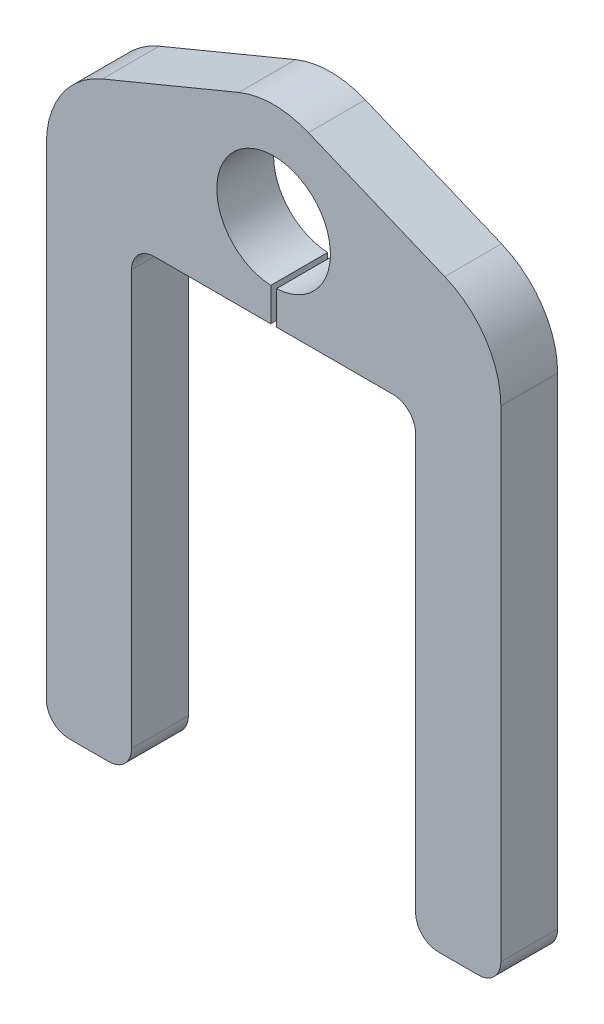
ISO-10303-21;
HEADER;
FILE_DESCRIPTION(('STEP AP214'),'2;1');
FILE_NAME('part.step','',(''),(''),'','','');
FILE_SCHEMA(('AUTOMOTIVE_DESIGN { 1 0 10303 214 1 1 1 1 }'));
ENDSEC;
DATA;
#1=APPLICATION_CONTEXT('core data for automotive mechanical design processes');
#2=APPLICATION_PROTOCOL_DEFINITION('international standard','automotive_design',2000,#1);
#3=PRODUCT_CONTEXT('',#1,'mechanical');
#4=PRODUCT('Part','Part','',(#3));
#5=PRODUCT_RELATED_PRODUCT_CATEGORY('part','',(#4));
#6=PRODUCT_DEFINITION_FORMATION('','',#4);
#7=PRODUCT_DEFINITION_CONTEXT('part definition',#1,'design');
#8=PRODUCT_DEFINITION('design','',#6,#7);
#9=PRODUCT_DEFINITION_SHAPE('','',#8);
#10=(LENGTH_UNIT() NAMED_UNIT(*) SI_UNIT(.MILLI.,.METRE.));
#11=(NAMED_UNIT(*) PLANE_ANGLE_UNIT() SI_UNIT($,.RADIAN.));
#12=(NAMED_UNIT(*) SI_UNIT($,.STERADIAN.) SOLID_ANGLE_UNIT());
#13=UNCERTAINTY_MEASURE_WITH_UNIT(LENGTH_MEASURE(1.E-05),#10,'distance_accuracy_value','');
#14=(GEOMETRIC_REPRESENTATION_CONTEXT(3) GLOBAL_UNCERTAINTY_ASSIGNED_CONTEXT((#13)) GLOBAL_UNIT_ASSIGNED_CONTEXT((#10,
#11,#12)) REPRESENTATION_CONTEXT('',''));
#15=CARTESIAN_POINT('',(0.,0.,0.));
#16=DIRECTION('',(0.,0.,1.));
#17=DIRECTION('',(1.,0.,0.));
#18=AXIS2_PLACEMENT_3D('',#15,#16,#17);
#19=CARTESIAN_POINT('',(376.037881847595,299.851744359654,31.75));
#20=DIRECTION('',(0.,1.,0.));
#21=DIRECTION('',(0.,0.,1.));
#22=AXIS2_PLACEMENT_3D('',#19,#20,#21);
#23=PLANE('',#22);
#24=DIRECTION('',(1.,0.,0.));
#25=VECTOR('',#24,1.);
#26=CARTESIAN_POINT('',(376.037881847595,299.851744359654,0.));
#27=LINE('',#26,#25);
#28=CARTESIAN_POINT('',(310.950381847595,299.851744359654,0.));
#29=VERTEX_POINT('',#28);
#30=CARTESIAN_POINT('',(376.037881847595,299.851744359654,0.));
#31=VERTEX_POINT('',#30);
#32=EDGE_CURVE('E215',#29,#31,#27,.T.);
#33=ORIENTED_EDGE('',*,*,#32,.T.);
#34=DIRECTION('',(0.,0.,-1.));
#35=VECTOR('',#34,1.);
#36=CARTESIAN_POINT('',(376.037881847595,299.851744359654,31.75));
#37=LINE('',#36,#35);
#38=CARTESIAN_POINT('',(376.037881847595,299.851744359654,31.75));
#39=VERTEX_POINT('',#38);
#40=EDGE_CURVE('E11',#39,#31,#37,.T.);
#41=ORIENTED_EDGE('',*,*,#40,.F.);
#42=DIRECTION('',(1.,0.,0.));
#43=VECTOR('',#42,1.);
#44=CARTESIAN_POINT('',(376.037881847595,299.851744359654,31.75));
#45=LINE('',#44,#43);
#46=CARTESIAN_POINT('',(310.950381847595,299.851744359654,31.75));
#47=VERTEX_POINT('',#46);
#48=EDGE_CURVE('E257',#47,#39,#45,.T.);
#49=ORIENTED_EDGE('',*,*,#48,.F.);
#50=DIRECTION('',(0.,0.,-1.));
#51=VECTOR('',#50,1.);
#52=CARTESIAN_POINT('',(310.950381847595,299.851744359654,31.75));
#53=LINE('',#52,#51);
#54=EDGE_CURVE('E211',#47,#29,#53,.T.);
#55=ORIENTED_EDGE('',*,*,#54,.T.);
#56=EDGE_LOOP('',(#33,#41,#49,#55));
#57=FACE_BOUND('',#56,.T.);
#58=ADVANCED_FACE('F35',(#57),#23,.F.);
#59=CARTESIAN_POINT('',(376.037881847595,287.151744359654,31.75));
#60=DIRECTION('',(0.,0.,-1.));
#61=DIRECTION('',(-1.,0.,0.));
#62=AXIS2_PLACEMENT_3D('',#59,#60,#61);
#63=CYLINDRICAL_SURFACE('',#62,12.7);
#64=CARTESIAN_POINT('',(376.037881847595,287.151744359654,0.));
#65=DIRECTION('',(0.,0.,-1.));
#66=DIRECTION('',(1.,0.,0.));
#67=AXIS2_PLACEMENT_3D('',#64,#65,#66);
#68=CIRCLE('',#67,12.7);
#69=CARTESIAN_POINT('',(388.737881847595,287.151744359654,0.));
#70=VERTEX_POINT('',#69);
#71=EDGE_CURVE('E218',#31,#70,#68,.T.);
#72=ORIENTED_EDGE('',*,*,#71,.T.);
#73=DIRECTION('',(0.,0.,-1.));
#74=VECTOR('',#73,1.);
#75=CARTESIAN_POINT('',(388.737881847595,287.151744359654,31.75));
#76=LINE('',#75,#74);
#77=CARTESIAN_POINT('',(388.737881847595,287.151744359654,31.75));
#78=VERTEX_POINT('',#77);
#79=EDGE_CURVE('E43',#78,#70,#76,.T.);
#80=ORIENTED_EDGE('',*,*,#79,.F.);
#81=CARTESIAN_POINT('',(376.037881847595,287.151744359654,31.75));
#82=DIRECTION('',(0.,0.,-1.));
#83=DIRECTION('',(1.,0.,0.));
#84=AXIS2_PLACEMENT_3D('',#81,#82,#83);
#85=CIRCLE('',#84,12.7);
#86=EDGE_CURVE('E136',#39,#78,#85,.T.);
#87=ORIENTED_EDGE('',*,*,#86,.F.);
#88=ORIENTED_EDGE('',*,*,#40,.T.);
#89=EDGE_LOOP('',(#72,#80,#87,#88));
#90=FACE_BOUND('',#89,.T.);
#91=ADVANCED_FACE('F385',(#90),#63,.F.);
#92=CARTESIAN_POINT('',(388.737881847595,287.151744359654,31.75));
#93=DIRECTION('',(1.,0.,0.));
#94=DIRECTION('',(0.,1.,0.));
#95=AXIS2_PLACEMENT_3D('',#92,#93,#94);
#96=PLANE('',#95);
#97=DIRECTION('',(0.,-1.,0.));
#98=VECTOR('',#97,1.);
#99=CARTESIAN_POINT('',(388.737881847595,287.151744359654,0.));
#100=LINE('',#99,#98);
#101=CARTESIAN_POINT('',(388.737881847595,55.3767443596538,0.));
#102=VERTEX_POINT('',#101);
#103=EDGE_CURVE('E220',#70,#102,#100,.T.);
#104=ORIENTED_EDGE('',*,*,#103,.T.);
#105=DIRECTION('',(0.,0.,-1.));
#106=VECTOR('',#105,1.);
#107=CARTESIAN_POINT('',(388.737881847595,55.3767443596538,31.75));
#108=LINE('',#107,#106);
#109=CARTESIAN_POINT('',(388.737881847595,55.3767443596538,31.75));
#110=VERTEX_POINT('',#109);
#111=EDGE_CURVE('E306',#110,#102,#108,.T.);
#112=ORIENTED_EDGE('',*,*,#111,.F.);
#113=DIRECTION('',(0.,-1.,0.));
#114=VECTOR('',#113,1.);
#115=CARTESIAN_POINT('',(388.737881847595,287.151744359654,31.75));
#116=LINE('',#115,#114);
#117=EDGE_CURVE('E314',#78,#110,#116,.T.);
#118=ORIENTED_EDGE('',*,*,#117,.F.);
#119=ORIENTED_EDGE('',*,*,#79,.T.);
#120=EDGE_LOOP('',(#104,#112,#118,#119));
#121=FACE_BOUND('',#120,.T.);
#122=ADVANCED_FACE('F312',(#121),#96,.F.);
#123=CARTESIAN_POINT('',(401.437881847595,55.3767443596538,31.75));
#124=DIRECTION('',(0.,0.,-1.));
#125=DIRECTION('',(-1.,0.,0.));
#126=AXIS2_PLACEMENT_3D('',#123,#124,#125);
#127=CYLINDRICAL_SURFACE('',#126,12.7);
#128=CARTESIAN_POINT('',(401.437881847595,55.3767443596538,0.));
#129=DIRECTION('',(0.,0.,1.));
#130=DIRECTION('',(1.,0.,0.));
#131=AXIS2_PLACEMENT_3D('',#128,#129,#130);
#132=CIRCLE('',#131,12.7);
#133=CARTESIAN_POINT('',(401.437881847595,42.6767443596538,0.));
#134=VERTEX_POINT('',#133);
#135=EDGE_CURVE('E222',#102,#134,#132,.T.);
#136=ORIENTED_EDGE('',*,*,#135,.T.);
#137=DIRECTION('',(0.,0.,-1.));
#138=VECTOR('',#137,1.);
#139=CARTESIAN_POINT('',(401.437881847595,42.6767443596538,31.75));
#140=LINE('',#139,#138);
#141=CARTESIAN_POINT('',(401.437881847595,42.6767443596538,31.75));
#142=VERTEX_POINT('',#141);
#143=EDGE_CURVE('E303',#142,#134,#140,.T.);
#144=ORIENTED_EDGE('',*,*,#143,.F.);
#145=CARTESIAN_POINT('',(401.437881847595,55.3767443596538,31.75));
#146=DIRECTION('',(0.,0.,1.));
#147=DIRECTION('',(1.,0.,0.));
#148=AXIS2_PLACEMENT_3D('',#145,#146,#147);
#149=CIRCLE('',#148,12.7);
#150=EDGE_CURVE('E332',#110,#142,#149,.T.);
#151=ORIENTED_EDGE('',*,*,#150,.F.);
#152=ORIENTED_EDGE('',*,*,#111,.T.);
#153=EDGE_LOOP('',(#136,#144,#151,#152));
#154=FACE_BOUND('',#153,.T.);
#155=ADVANCED_FACE('F323',(#154),#127,.T.);
#156=CARTESIAN_POINT('',(401.437881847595,42.6767443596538,31.75));
#157=DIRECTION('',(0.,1.,0.));
#158=DIRECTION('',(0.,0.,1.));
#159=AXIS2_PLACEMENT_3D('',#156,#157,#158);
#160=PLANE('',#159);
#161=DIRECTION('',(1.,0.,0.));
#162=VECTOR('',#161,1.);
#163=CARTESIAN_POINT('',(401.437881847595,42.6767443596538,0.));
#164=LINE('',#163,#162);
#165=CARTESIAN_POINT('',(423.662881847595,42.6767443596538,0.));
#166=VERTEX_POINT('',#165);
#167=EDGE_CURVE('E224',#134,#166,#164,.T.);
#168=ORIENTED_EDGE('',*,*,#167,.T.);
#169=DIRECTION('',(0.,0.,-1.));
#170=VECTOR('',#169,1.);
#171=CARTESIAN_POINT('',(423.662881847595,42.6767443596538,31.75));
#172=LINE('',#171,#170);
#173=CARTESIAN_POINT('',(423.662881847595,42.6767443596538,31.75));
#174=VERTEX_POINT('',#173);
#175=EDGE_CURVE('E300',#174,#166,#172,.T.);
#176=ORIENTED_EDGE('',*,*,#175,.F.);
#177=DIRECTION('',(1.,0.,0.));
#178=VECTOR('',#177,1.);
#179=CARTESIAN_POINT('',(401.437881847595,42.6767443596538,31.75));
#180=LINE('',#179,#178);
#181=EDGE_CURVE('E329',#142,#174,#180,.T.);
#182=ORIENTED_EDGE('',*,*,#181,.F.);
#183=ORIENTED_EDGE('',*,*,#143,.T.);
#184=EDGE_LOOP('',(#168,#176,#182,#183));
#185=FACE_BOUND('',#184,.T.);
#186=ADVANCED_FACE('F327',(#185),#160,.F.);
#187=CARTESIAN_POINT('',(423.662881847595,55.3767443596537,31.75));
#188=DIRECTION('',(0.,0.,-1.));
#189=DIRECTION('',(-1.,0.,0.));
#190=AXIS2_PLACEMENT_3D('',#187,#188,#189);
#191=CYLINDRICAL_SURFACE('',#190,12.7);
#192=CARTESIAN_POINT('',(423.662881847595,55.3767443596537,0.));
#193=DIRECTION('',(0.,0.,1.));
#194=DIRECTION('',(1.,0.,0.));
#195=AXIS2_PLACEMENT_3D('',#192,#193,#194);
#196=CIRCLE('',#195,12.7);
#197=CARTESIAN_POINT('',(436.362881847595,55.3767443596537,0.));
#198=VERTEX_POINT('',#197);
#199=EDGE_CURVE('E226',#166,#198,#196,.T.);
#200=ORIENTED_EDGE('',*,*,#199,.T.);
#201=DIRECTION('',(0.,0.,-1.));
#202=VECTOR('',#201,1.);
#203=CARTESIAN_POINT('',(436.362881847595,55.3767443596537,31.75));
#204=LINE('',#203,#202);
#205=CARTESIAN_POINT('',(436.362881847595,55.3767443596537,31.75));
#206=VERTEX_POINT('',#205);
#207=EDGE_CURVE('E297',#206,#198,#204,.T.);
#208=ORIENTED_EDGE('',*,*,#207,.F.);
#209=CARTESIAN_POINT('',(423.662881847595,55.3767443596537,31.75));
#210=DIRECTION('',(0.,0.,1.));
#211=DIRECTION('',(1.,0.,0.));
#212=AXIS2_PLACEMENT_3D('',#209,#210,#211);
#213=CIRCLE('',#212,12.7);
#214=EDGE_CURVE('E331',#174,#206,#213,.T.);
#215=ORIENTED_EDGE('',*,*,#214,.F.);
#216=ORIENTED_EDGE('',*,*,#175,.T.);
#217=EDGE_LOOP('',(#200,#208,#215,#216));
#218=FACE_BOUND('',#217,.T.);
#219=ADVANCED_FACE('F398',(#218),#191,.T.);
#220=CARTESIAN_POINT('',(436.362881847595,324.39371610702,31.75));
#221=DIRECTION('',(-1.,0.,0.));
#222=DIRECTION('',(0.,-1.,0.));
#223=AXIS2_PLACEMENT_3D('',#220,#221,#222);
#224=PLANE('',#223);
#225=DIRECTION('',(0.,1.,0.));
#226=VECTOR('',#225,1.);
#227=CARTESIAN_POINT('',(436.362881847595,324.39371610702,0.));
#228=LINE('',#227,#226);
#229=CARTESIAN_POINT('',(436.362881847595,324.39371610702,0.));
#230=VERTEX_POINT('',#229);
#231=EDGE_CURVE('E228',#198,#230,#228,.T.);
#232=ORIENTED_EDGE('',*,*,#231,.T.);
#233=DIRECTION('',(0.,0.,-1.));
#234=VECTOR('',#233,1.);
#235=CARTESIAN_POINT('',(436.362881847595,324.39371610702,31.75));
#236=LINE('',#235,#234);
#237=CARTESIAN_POINT('',(436.362881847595,324.39371610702,31.75));
#238=VERTEX_POINT('',#237);
#239=EDGE_CURVE('E294',#238,#230,#236,.T.);
#240=ORIENTED_EDGE('',*,*,#239,.F.);
#241=DIRECTION('',(0.,1.,0.));
#242=VECTOR('',#241,1.);
#243=CARTESIAN_POINT('',(436.362881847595,324.39371610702,31.75));
#244=LINE('',#243,#242);
#245=EDGE_CURVE('E334',#206,#238,#244,.T.);
#246=ORIENTED_EDGE('',*,*,#245,.F.);
#247=ORIENTED_EDGE('',*,*,#207,.T.);
#248=EDGE_LOOP('',(#232,#240,#246,#247));
#249=FACE_BOUND('',#248,.T.);
#250=ADVANCED_FACE('F401',(#249),#224,.F.);
#251=CARTESIAN_POINT('',(385.562881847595,324.39371610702,31.75));
#252=DIRECTION('',(0.,0.,-1.));
#253=DIRECTION('',(-1.,0.,0.));
#254=AXIS2_PLACEMENT_3D('',#251,#252,#253);
#255=CYLINDRICAL_SURFACE('',#254,50.8);
#256=CARTESIAN_POINT('',(385.562881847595,324.39371610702,0.));
#257=DIRECTION('',(0.,0.,1.));
#258=DIRECTION('',(1.,0.,0.));
#259=AXIS2_PLACEMENT_3D('',#256,#257,#258);
#260=CIRCLE('',#259,50.8);
#261=CARTESIAN_POINT('',(405.017618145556,371.320821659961,0.));
#262=VERTEX_POINT('',#261);
#263=EDGE_CURVE('E230',#230,#262,#260,.T.);
#264=ORIENTED_EDGE('',*,*,#263,.T.);
#265=DIRECTION('',(0.,0.,-1.));
#266=VECTOR('',#265,1.);
#267=CARTESIAN_POINT('',(405.017618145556,371.320821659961,31.75));
#268=LINE('',#267,#266);
#269=CARTESIAN_POINT('',(405.017618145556,371.320821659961,31.75));
#270=VERTEX_POINT('',#269);
#271=EDGE_CURVE('E291',#270,#262,#268,.T.);
#272=ORIENTED_EDGE('',*,*,#271,.F.);
#273=CARTESIAN_POINT('',(385.562881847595,324.39371610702,31.75));
#274=DIRECTION('',(0.,0.,1.));
#275=DIRECTION('',(1.,0.,0.));
#276=AXIS2_PLACEMENT_3D('',#273,#274,#275);
#277=CIRCLE('',#276,50.8);
#278=EDGE_CURVE('E340',#238,#270,#277,.T.);
#279=ORIENTED_EDGE('',*,*,#278,.F.);
#280=ORIENTED_EDGE('',*,*,#239,.T.);
#281=EDGE_LOOP('',(#264,#272,#279,#280));
#282=FACE_BOUND('',#281,.T.);
#283=ADVANCED_FACE('F405',(#282),#255,.T.);
#284=CARTESIAN_POINT('',(405.017618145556,371.320821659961,31.75));
#285=DIRECTION('',(-0.382967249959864,-0.923761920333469,0.));
#286=DIRECTION('',(0.923761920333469,-0.382967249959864,0.));
#287=AXIS2_PLACEMENT_3D('',#284,#285,#286);
#288=PLANE('',#287);
#289=DIRECTION('',(-0.923761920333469,0.382967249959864,0.));
#290=VECTOR('',#289,1.);
#291=CARTESIAN_POINT('',(405.017618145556,371.320821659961,0.));
#292=LINE('',#291,#290);
#293=CARTESIAN_POINT('',(328.817618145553,402.911325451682,0.));
#294=VERTEX_POINT('',#293);
#295=EDGE_CURVE('E232',#262,#294,#292,.T.);
#296=ORIENTED_EDGE('',*,*,#295,.T.);
#297=DIRECTION('',(0.,0.,-1.));
#298=VECTOR('',#297,1.);
#299=CARTESIAN_POINT('',(328.817618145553,402.911325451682,31.75));
#300=LINE('',#299,#298);
#301=CARTESIAN_POINT('',(328.817618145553,402.911325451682,31.75));
#302=VERTEX_POINT('',#301);
#303=EDGE_CURVE('E288',#302,#294,#300,.T.);
#304=ORIENTED_EDGE('',*,*,#303,.F.);
#305=DIRECTION('',(-0.923761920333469,0.382967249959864,0.));
#306=VECTOR('',#305,1.);
#307=CARTESIAN_POINT('',(405.017618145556,371.320821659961,31.75));
#308=LINE('',#307,#306);
#309=EDGE_CURVE('E342',#270,#302,#308,.T.);
#310=ORIENTED_EDGE('',*,*,#309,.F.);
#311=ORIENTED_EDGE('',*,*,#271,.T.);
#312=EDGE_LOOP('',(#296,#304,#310,#311));
#313=FACE_BOUND('',#312,.T.);
#314=ADVANCED_FACE('F409',(#313),#288,.F.);
#315=CARTESIAN_POINT('',(309.362881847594,355.984219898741,31.75));
#316=DIRECTION('',(0.,0.,-1.));
#317=DIRECTION('',(-1.,0.,0.));
#318=AXIS2_PLACEMENT_3D('',#315,#316,#317);
#319=CYLINDRICAL_SURFACE('',#318,50.8);
#320=CARTESIAN_POINT('',(309.362881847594,355.984219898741,0.));
#321=DIRECTION('',(0.,0.,1.));
#322=DIRECTION('',(1.,0.,0.));
#323=AXIS2_PLACEMENT_3D('',#320,#321,#322);
#324=CIRCLE('',#323,50.8);
#325=CARTESIAN_POINT('',(289.908145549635,402.911325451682,0.));
#326=VERTEX_POINT('',#325);
#327=EDGE_CURVE('E234',#294,#326,#324,.T.);
#328=ORIENTED_EDGE('',*,*,#327,.T.);
#329=DIRECTION('',(0.,0.,-1.));
#330=VECTOR('',#329,1.);
#331=CARTESIAN_POINT('',(289.908145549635,402.911325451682,31.75));
#332=LINE('',#331,#330);
#333=CARTESIAN_POINT('',(289.908145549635,402.911325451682,31.75));
#334=VERTEX_POINT('',#333);
#335=EDGE_CURVE('E285',#334,#326,#332,.T.);
#336=ORIENTED_EDGE('',*,*,#335,.F.);
#337=CARTESIAN_POINT('',(309.362881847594,355.984219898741,31.75));
#338=DIRECTION('',(0.,0.,1.));
#339=DIRECTION('',(1.,0.,0.));
#340=AXIS2_PLACEMENT_3D('',#337,#338,#339);
#341=CIRCLE('',#340,50.8);
#342=EDGE_CURVE('E344',#302,#334,#341,.T.);
#343=ORIENTED_EDGE('',*,*,#342,.F.);
#344=ORIENTED_EDGE('',*,*,#303,.T.);
#345=EDGE_LOOP('',(#328,#336,#343,#344));
#346=FACE_BOUND('',#345,.T.);
#347=ADVANCED_FACE('F413',(#346),#319,.T.);
#348=CARTESIAN_POINT('',(213.708145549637,371.320821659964,31.75));
#349=DIRECTION('',(0.382967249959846,-0.923761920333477,0.));
#350=DIRECTION('',(0.923761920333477,0.382967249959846,0.));
#351=AXIS2_PLACEMENT_3D('',#348,#349,#350);
#352=PLANE('',#351);
#353=DIRECTION('',(-0.923761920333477,-0.382967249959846,0.));
#354=VECTOR('',#353,1.);
#355=CARTESIAN_POINT('',(213.708145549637,371.320821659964,0.));
#356=LINE('',#355,#354);
#357=CARTESIAN_POINT('',(213.708145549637,371.320821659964,0.));
#358=VERTEX_POINT('',#357);
#359=EDGE_CURVE('E236',#326,#358,#356,.T.);
#360=ORIENTED_EDGE('',*,*,#359,.T.);
#361=DIRECTION('',(0.,0.,-1.));
#362=VECTOR('',#361,1.);
#363=CARTESIAN_POINT('',(213.708145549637,371.320821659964,31.75));
#364=LINE('',#363,#362);
#365=CARTESIAN_POINT('',(213.708145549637,371.320821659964,31.75));
#366=VERTEX_POINT('',#365);
#367=EDGE_CURVE('E282',#366,#358,#364,.T.);
#368=ORIENTED_EDGE('',*,*,#367,.F.);
#369=DIRECTION('',(-0.923761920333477,-0.382967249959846,0.));
#370=VECTOR('',#369,1.);
#371=CARTESIAN_POINT('',(213.708145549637,371.320821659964,31.75));
#372=LINE('',#371,#370);
#373=EDGE_CURVE('E346',#334,#366,#372,.T.);
#374=ORIENTED_EDGE('',*,*,#373,.F.);
#375=ORIENTED_EDGE('',*,*,#335,.T.);
#376=EDGE_LOOP('',(#360,#368,#374,#375));
#377=FACE_BOUND('',#376,.T.);
#378=ADVANCED_FACE('F417',(#377),#352,.F.);
#379=CARTESIAN_POINT('',(233.162881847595,324.393716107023,31.75));
#380=DIRECTION('',(0.,0.,-1.));
#381=DIRECTION('',(-1.,0.,0.));
#382=AXIS2_PLACEMENT_3D('',#379,#380,#381);
#383=CYLINDRICAL_SURFACE('',#382,50.8);
#384=CARTESIAN_POINT('',(233.162881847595,324.393716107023,0.));
#385=DIRECTION('',(0.,0.,1.));
#386=DIRECTION('',(1.,0.,0.));
#387=AXIS2_PLACEMENT_3D('',#384,#385,#386);
#388=CIRCLE('',#387,50.8);
#389=CARTESIAN_POINT('',(182.362881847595,324.393716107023,0.));
#390=VERTEX_POINT('',#389);
#391=EDGE_CURVE('E238',#358,#390,#388,.T.);
#392=ORIENTED_EDGE('',*,*,#391,.T.);
#393=DIRECTION('',(0.,0.,-1.));
#394=VECTOR('',#393,1.);
#395=CARTESIAN_POINT('',(182.362881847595,324.393716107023,31.75));
#396=LINE('',#395,#394);
#397=CARTESIAN_POINT('',(182.362881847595,324.393716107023,31.75));
#398=VERTEX_POINT('',#397);
#399=EDGE_CURVE('E279',#398,#390,#396,.T.);
#400=ORIENTED_EDGE('',*,*,#399,.F.);
#401=CARTESIAN_POINT('',(233.162881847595,324.393716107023,31.75));
#402=DIRECTION('',(0.,0.,1.));
#403=DIRECTION('',(1.,0.,0.));
#404=AXIS2_PLACEMENT_3D('',#401,#402,#403);
#405=CIRCLE('',#404,50.8);
#406=EDGE_CURVE('E348',#366,#398,#405,.T.);
#407=ORIENTED_EDGE('',*,*,#406,.F.);
#408=ORIENTED_EDGE('',*,*,#367,.T.);
#409=EDGE_LOOP('',(#392,#400,#407,#408));
#410=FACE_BOUND('',#409,.T.);
#411=ADVANCED_FACE('F421',(#410),#383,.T.);
#412=CARTESIAN_POINT('',(182.362881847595,324.393716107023,31.75));
#413=DIRECTION('',(1.,0.,0.));
#414=DIRECTION('',(0.,1.,0.));
#415=AXIS2_PLACEMENT_3D('',#412,#413,#414);
#416=PLANE('',#415);
#417=DIRECTION('',(0.,-1.,0.));
#418=VECTOR('',#417,1.);
#419=CARTESIAN_POINT('',(182.362881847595,324.393716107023,0.));
#420=LINE('',#419,#418);
#421=CARTESIAN_POINT('',(182.362881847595,55.3767443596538,0.));
#422=VERTEX_POINT('',#421);
#423=EDGE_CURVE('E240',#390,#422,#420,.T.);
#424=ORIENTED_EDGE('',*,*,#423,.T.);
#425=DIRECTION('',(0.,0.,-1.));
#426=VECTOR('',#425,1.);
#427=CARTESIAN_POINT('',(182.362881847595,55.3767443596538,31.75));
#428=LINE('',#427,#426);
#429=CARTESIAN_POINT('',(182.362881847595,55.3767443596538,31.75));
#430=VERTEX_POINT('',#429);
#431=EDGE_CURVE('E276',#430,#422,#428,.T.);
#432=ORIENTED_EDGE('',*,*,#431,.F.);
#433=DIRECTION('',(0.,-1.,0.));
#434=VECTOR('',#433,1.);
#435=CARTESIAN_POINT('',(182.362881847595,324.393716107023,31.75));
#436=LINE('',#435,#434);
#437=EDGE_CURVE('E350',#398,#430,#436,.T.);
#438=ORIENTED_EDGE('',*,*,#437,.F.);
#439=ORIENTED_EDGE('',*,*,#399,.T.);
#440=EDGE_LOOP('',(#424,#432,#438,#439));
#441=FACE_BOUND('',#440,.T.);
#442=ADVANCED_FACE('F425',(#441),#416,.F.);
#443=CARTESIAN_POINT('',(195.062881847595,55.3767443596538,31.75));
#444=DIRECTION('',(0.,0.,-1.));
#445=DIRECTION('',(-1.,0.,0.));
#446=AXIS2_PLACEMENT_3D('',#443,#444,#445);
#447=CYLINDRICAL_SURFACE('',#446,12.7);
#448=CARTESIAN_POINT('',(195.062881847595,55.3767443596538,0.));
#449=DIRECTION('',(0.,0.,1.));
#450=DIRECTION('',(1.,0.,0.));
#451=AXIS2_PLACEMENT_3D('',#448,#449,#450);
#452=CIRCLE('',#451,12.7);
#453=CARTESIAN_POINT('',(195.062881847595,42.6767443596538,0.));
#454=VERTEX_POINT('',#453);
#455=EDGE_CURVE('E242',#422,#454,#452,.T.);
#456=ORIENTED_EDGE('',*,*,#455,.T.);
#457=DIRECTION('',(0.,0.,-1.));
#458=VECTOR('',#457,1.);
#459=CARTESIAN_POINT('',(195.062881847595,42.6767443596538,31.75));
#460=LINE('',#459,#458);
#461=CARTESIAN_POINT('',(195.062881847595,42.6767443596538,31.75));
#462=VERTEX_POINT('',#461);
#463=EDGE_CURVE('E273',#462,#454,#460,.T.);
#464=ORIENTED_EDGE('',*,*,#463,.F.);
#465=CARTESIAN_POINT('',(195.062881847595,55.3767443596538,31.75));
#466=DIRECTION('',(0.,0.,1.));
#467=DIRECTION('',(1.,0.,0.));
#468=AXIS2_PLACEMENT_3D('',#465,#466,#467);
#469=CIRCLE('',#468,12.7);
#470=EDGE_CURVE('E352',#430,#462,#469,.T.);
#471=ORIENTED_EDGE('',*,*,#470,.F.);
#472=ORIENTED_EDGE('',*,*,#431,.T.);
#473=EDGE_LOOP('',(#456,#464,#471,#472));
#474=FACE_BOUND('',#473,.T.);
#475=ADVANCED_FACE('F429',(#474),#447,.T.);
#476=CARTESIAN_POINT('',(217.287881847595,42.6767443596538,31.75));
#477=DIRECTION('',(0.,1.,0.));
#478=DIRECTION('',(0.,0.,1.));
#479=AXIS2_PLACEMENT_3D('',#476,#477,#478);
#480=PLANE('',#479);
#481=DIRECTION('',(1.,0.,0.));
#482=VECTOR('',#481,1.);
#483=CARTESIAN_POINT('',(217.287881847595,42.6767443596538,0.));
#484=LINE('',#483,#482);
#485=CARTESIAN_POINT('',(217.287881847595,42.6767443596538,0.));
#486=VERTEX_POINT('',#485);
#487=EDGE_CURVE('E244',#454,#486,#484,.T.);
#488=ORIENTED_EDGE('',*,*,#487,.T.);
#489=DIRECTION('',(0.,0.,-1.));
#490=VECTOR('',#489,1.);
#491=CARTESIAN_POINT('',(217.287881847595,42.6767443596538,31.75));
#492=LINE('',#491,#490);
#493=CARTESIAN_POINT('',(217.287881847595,42.6767443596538,31.75));
#494=VERTEX_POINT('',#493);
#495=EDGE_CURVE('E270',#494,#486,#492,.T.);
#496=ORIENTED_EDGE('',*,*,#495,.F.);
#497=DIRECTION('',(1.,0.,0.));
#498=VECTOR('',#497,1.);
#499=CARTESIAN_POINT('',(217.287881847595,42.6767443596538,31.75));
#500=LINE('',#499,#498);
#501=EDGE_CURVE('E354',#462,#494,#500,.T.);
#502=ORIENTED_EDGE('',*,*,#501,.F.);
#503=ORIENTED_EDGE('',*,*,#463,.T.);
#504=EDGE_LOOP('',(#488,#496,#502,#503));
#505=FACE_BOUND('',#504,.T.);
#506=ADVANCED_FACE('F433',(#505),#480,.F.);
#507=CARTESIAN_POINT('',(217.287881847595,55.3767443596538,31.75));
#508=DIRECTION('',(0.,0.,-1.));
#509=DIRECTION('',(-1.,0.,0.));
#510=AXIS2_PLACEMENT_3D('',#507,#508,#509);
#511=CYLINDRICAL_SURFACE('',#510,12.7);
#512=CARTESIAN_POINT('',(217.287881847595,55.3767443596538,0.));
#513=DIRECTION('',(0.,0.,1.));
#514=DIRECTION('',(1.,0.,0.));
#515=AXIS2_PLACEMENT_3D('',#512,#513,#514);
#516=CIRCLE('',#515,12.7);
#517=CARTESIAN_POINT('',(229.987881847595,55.3767443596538,0.));
#518=VERTEX_POINT('',#517);
#519=EDGE_CURVE('E246',#486,#518,#516,.T.);
#520=ORIENTED_EDGE('',*,*,#519,.T.);
#521=DIRECTION('',(0.,0.,-1.));
#522=VECTOR('',#521,1.);
#523=CARTESIAN_POINT('',(229.987881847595,55.3767443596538,31.75));
#524=LINE('',#523,#522);
#525=CARTESIAN_POINT('',(229.987881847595,55.3767443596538,31.75));
#526=VERTEX_POINT('',#525);
#527=EDGE_CURVE('E267',#526,#518,#524,.T.);
#528=ORIENTED_EDGE('',*,*,#527,.F.);
#529=CARTESIAN_POINT('',(217.287881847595,55.3767443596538,31.75));
#530=DIRECTION('',(0.,0.,1.));
#531=DIRECTION('',(1.,0.,0.));
#532=AXIS2_PLACEMENT_3D('',#529,#530,#531);
#533=CIRCLE('',#532,12.7);
#534=EDGE_CURVE('E356',#494,#526,#533,.T.);
#535=ORIENTED_EDGE('',*,*,#534,.F.);
#536=ORIENTED_EDGE('',*,*,#495,.T.);
#537=EDGE_LOOP('',(#520,#528,#535,#536));
#538=FACE_BOUND('',#537,.T.);
#539=ADVANCED_FACE('F437',(#538),#511,.T.);
#540=CARTESIAN_POINT('',(229.987881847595,287.151744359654,31.75));
#541=DIRECTION('',(-1.,0.,0.));
#542=DIRECTION('',(0.,-1.,0.));
#543=AXIS2_PLACEMENT_3D('',#540,#541,#542);
#544=PLANE('',#543);
#545=DIRECTION('',(0.,1.,0.));
#546=VECTOR('',#545,1.);
#547=CARTESIAN_POINT('',(229.987881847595,287.151744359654,0.));
#548=LINE('',#547,#546);
#549=CARTESIAN_POINT('',(229.987881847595,287.151744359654,0.));
#550=VERTEX_POINT('',#549);
#551=EDGE_CURVE('E248',#518,#550,#548,.T.);
#552=ORIENTED_EDGE('',*,*,#551,.T.);
#553=DIRECTION('',(0.,0.,-1.));
#554=VECTOR('',#553,1.);
#555=CARTESIAN_POINT('',(229.987881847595,287.151744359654,31.75));
#556=LINE('',#555,#554);
#557=CARTESIAN_POINT('',(229.987881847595,287.151744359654,31.75));
#558=VERTEX_POINT('',#557);
#559=EDGE_CURVE('E264',#558,#550,#556,.T.);
#560=ORIENTED_EDGE('',*,*,#559,.F.);
#561=DIRECTION('',(0.,1.,0.));
#562=VECTOR('',#561,1.);
#563=CARTESIAN_POINT('',(229.987881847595,287.151744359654,31.75));
#564=LINE('',#563,#562);
#565=EDGE_CURVE('E358',#526,#558,#564,.T.);
#566=ORIENTED_EDGE('',*,*,#565,.F.);
#567=ORIENTED_EDGE('',*,*,#527,.T.);
#568=EDGE_LOOP('',(#552,#560,#566,#567));
#569=FACE_BOUND('',#568,.T.);
#570=ADVANCED_FACE('F441',(#569),#544,.F.);
#571=CARTESIAN_POINT('',(242.687881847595,287.151744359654,31.75));
#572=DIRECTION('',(0.,0.,-1.));
#573=DIRECTION('',(-1.,0.,0.));
#574=AXIS2_PLACEMENT_3D('',#571,#572,#573);
#575=CYLINDRICAL_SURFACE('',#574,12.7);
#576=CARTESIAN_POINT('',(242.687881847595,287.151744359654,0.));
#577=DIRECTION('',(0.,0.,-1.));
#578=DIRECTION('',(1.,0.,0.));
#579=AXIS2_PLACEMENT_3D('',#576,#577,#578);
#580=CIRCLE('',#579,12.7);
#581=CARTESIAN_POINT('',(242.687881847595,299.851744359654,0.));
#582=VERTEX_POINT('',#581);
#583=EDGE_CURVE('E250',#550,#582,#580,.T.);
#584=ORIENTED_EDGE('',*,*,#583,.T.);
#585=DIRECTION('',(0.,0.,-1.));
#586=VECTOR('',#585,1.);
#587=CARTESIAN_POINT('',(242.687881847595,299.851744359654,31.75));
#588=LINE('',#587,#586);
#589=CARTESIAN_POINT('',(242.687881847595,299.851744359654,31.75));
#590=VERTEX_POINT('',#589);
#591=EDGE_CURVE('E261',#590,#582,#588,.T.);
#592=ORIENTED_EDGE('',*,*,#591,.F.);
#593=CARTESIAN_POINT('',(242.687881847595,287.151744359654,31.75));
#594=DIRECTION('',(0.,0.,-1.));
#595=DIRECTION('',(1.,0.,0.));
#596=AXIS2_PLACEMENT_3D('',#593,#594,#595);
#597=CIRCLE('',#596,12.7);
#598=EDGE_CURVE('E360',#558,#590,#597,.T.);
#599=ORIENTED_EDGE('',*,*,#598,.F.);
#600=ORIENTED_EDGE('',*,*,#559,.T.);
#601=EDGE_LOOP('',(#584,#592,#599,#600));
#602=FACE_BOUND('',#601,.T.);
#603=ADVANCED_FACE('F366',(#602),#575,.F.);
#604=CARTESIAN_POINT('',(307.775381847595,299.851744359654,31.75));
#605=DIRECTION('',(0.,1.,0.));
#606=DIRECTION('',(0.,0.,1.));
#607=AXIS2_PLACEMENT_3D('',#604,#605,#606);
#608=PLANE('',#607);
#609=DIRECTION('',(1.,0.,0.));
#610=VECTOR('',#609,1.);
#611=CARTESIAN_POINT('',(307.775381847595,299.851744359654,0.));
#612=LINE('',#611,#610);
#613=CARTESIAN_POINT('',(307.775381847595,299.851744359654,0.));
#614=VERTEX_POINT('',#613);
#615=EDGE_CURVE('E252',#582,#614,#612,.T.);
#616=ORIENTED_EDGE('',*,*,#615,.T.);
#617=DIRECTION('',(0.,0.,-1.));
#618=VECTOR('',#617,1.);
#619=CARTESIAN_POINT('',(307.775381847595,299.851744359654,31.75));
#620=LINE('',#619,#618);
#621=CARTESIAN_POINT('',(307.775381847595,299.851744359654,31.75));
#622=VERTEX_POINT('',#621);
#623=EDGE_CURVE('E206',#622,#614,#620,.T.);
#624=ORIENTED_EDGE('',*,*,#623,.F.);
#625=DIRECTION('',(1.,0.,0.));
#626=VECTOR('',#625,1.);
#627=CARTESIAN_POINT('',(307.775381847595,299.851744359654,31.75));
#628=LINE('',#627,#626);
#629=EDGE_CURVE('E197',#590,#622,#628,.T.);
#630=ORIENTED_EDGE('',*,*,#629,.F.);
#631=ORIENTED_EDGE('',*,*,#591,.T.);
#632=EDGE_LOOP('',(#616,#624,#630,#631));
#633=FACE_BOUND('',#632,.T.);
#634=ADVANCED_FACE('F370',(#633),#608,.F.);
#635=CARTESIAN_POINT('',(307.775381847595,299.851744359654,31.75));
#636=DIRECTION('',(-1.,0.,0.));
#637=DIRECTION('',(0.,0.,1.));
#638=AXIS2_PLACEMENT_3D('',#635,#636,#637);
#639=PLANE('',#638);
#640=DIRECTION('',(0.,1.,0.));
#641=VECTOR('',#640,1.);
#642=CARTESIAN_POINT('',(307.775381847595,299.851744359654,0.));
#643=LINE('',#642,#641);
#644=CARTESIAN_POINT('',(307.775381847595,318.47447049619,0.));
#645=VERTEX_POINT('',#644);
#646=EDGE_CURVE('E205',#614,#645,#643,.T.);
#647=ORIENTED_EDGE('',*,*,#646,.T.);
#648=DIRECTION('',(0.,0.,-1.));
#649=VECTOR('',#648,1.);
#650=CARTESIAN_POINT('',(307.775381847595,318.47447049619,31.75));
#651=LINE('',#650,#649);
#652=CARTESIAN_POINT('',(307.775381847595,318.47447049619,31.75));
#653=VERTEX_POINT('',#652);
#654=EDGE_CURVE('E202',#653,#645,#651,.T.);
#655=ORIENTED_EDGE('',*,*,#654,.F.);
#656=DIRECTION('',(0.,1.,0.));
#657=VECTOR('',#656,1.);
#658=CARTESIAN_POINT('',(307.775381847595,299.851744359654,31.75));
#659=LINE('',#658,#657);
#660=EDGE_CURVE('E191',#622,#653,#659,.T.);
#661=ORIENTED_EDGE('',*,*,#660,.F.);
#662=ORIENTED_EDGE('',*,*,#623,.T.);
#663=EDGE_LOOP('',(#647,#655,#661,#662));
#664=FACE_BOUND('',#663,.T.);
#665=ADVANCED_FACE('F203',(#664),#639,.F.);
#666=CARTESIAN_POINT('',(309.362881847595,350.184758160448,31.75));
#667=DIRECTION('',(0.,0.,-1.));
#668=DIRECTION('',(-1.,0.,0.));
#669=AXIS2_PLACEMENT_3D('',#666,#667,#668);
#670=CYLINDRICAL_SURFACE('',#669,31.7500000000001);
#671=CARTESIAN_POINT('',(309.362881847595,350.184758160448,0.));
#672=DIRECTION('',(0.,0.,-1.));
#673=DIRECTION('',(1.,0.,0.));
#674=AXIS2_PLACEMENT_3D('',#671,#672,#673);
#675=CIRCLE('',#674,31.7500000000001);
#676=CARTESIAN_POINT('',(310.950381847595,318.47447049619,0.));
#677=VERTEX_POINT('',#676);
#678=EDGE_CURVE('E122',#645,#677,#675,.T.);
#679=ORIENTED_EDGE('',*,*,#678,.T.);
#680=DIRECTION('',(0.,0.,-1.));
#681=VECTOR('',#680,1.);
#682=CARTESIAN_POINT('',(310.950381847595,318.47447049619,31.75));
#683=LINE('',#682,#681);
#684=CARTESIAN_POINT('',(310.950381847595,318.47447049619,31.75));
#685=VERTEX_POINT('',#684);
#686=EDGE_CURVE('E207',#685,#677,#683,.T.);
#687=ORIENTED_EDGE('',*,*,#686,.F.);
#688=CARTESIAN_POINT('',(309.362881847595,350.184758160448,31.75));
#689=DIRECTION('',(0.,0.,-1.));
#690=DIRECTION('',(1.,0.,0.));
#691=AXIS2_PLACEMENT_3D('',#688,#689,#690);
#692=CIRCLE('',#691,31.7500000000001);
#693=EDGE_CURVE('E195',#653,#685,#692,.T.);
#694=ORIENTED_EDGE('',*,*,#693,.F.);
#695=ORIENTED_EDGE('',*,*,#654,.T.);
#696=EDGE_LOOP('',(#679,#687,#694,#695));
#697=FACE_BOUND('',#696,.T.);
#698=ADVANCED_FACE('F209',(#697),#670,.F.);
#699=CARTESIAN_POINT('',(310.950381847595,299.851744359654,31.75));
#700=DIRECTION('',(1.,0.,0.));
#701=DIRECTION('',(0.,0.,-1.));
#702=AXIS2_PLACEMENT_3D('',#699,#700,#701);
#703=PLANE('',#702);
#704=DIRECTION('',(0.,-1.,0.));
#705=VECTOR('',#704,1.);
#706=CARTESIAN_POINT('',(310.950381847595,299.851744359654,0.));
#707=LINE('',#706,#705);
#708=EDGE_CURVE('E128',#677,#29,#707,.T.);
#709=ORIENTED_EDGE('',*,*,#708,.T.);
#710=ORIENTED_EDGE('',*,*,#54,.F.);
#711=DIRECTION('',(0.,-1.,0.));
#712=VECTOR('',#711,1.);
#713=CARTESIAN_POINT('',(310.950381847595,299.851744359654,31.75));
#714=LINE('',#713,#712);
#715=EDGE_CURVE('E51',#685,#47,#714,.T.);
#716=ORIENTED_EDGE('',*,*,#715,.F.);
#717=ORIENTED_EDGE('',*,*,#686,.T.);
#718=EDGE_LOOP('',(#709,#710,#716,#717));
#719=FACE_BOUND('',#718,.T.);
#720=ADVANCED_FACE('F374',(#719),#703,.F.);
#721=CARTESIAN_POINT('',(309.362881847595,350.184758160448,31.75));
#722=DIRECTION('',(0.,0.,1.));
#723=DIRECTION('',(1.,0.,0.));
#724=AXIS2_PLACEMENT_3D('',#721,#722,#723);
#725=PLANE('',#724);
#726=ORIENTED_EDGE('',*,*,#48,.T.);
#727=ORIENTED_EDGE('',*,*,#86,.T.);
#728=ORIENTED_EDGE('',*,*,#117,.T.);
#729=ORIENTED_EDGE('',*,*,#150,.T.);
#730=ORIENTED_EDGE('',*,*,#181,.T.);
#731=ORIENTED_EDGE('',*,*,#214,.T.);
#732=ORIENTED_EDGE('',*,*,#245,.T.);
#733=ORIENTED_EDGE('',*,*,#278,.T.);
#734=ORIENTED_EDGE('',*,*,#309,.T.);
#735=ORIENTED_EDGE('',*,*,#342,.T.);
#736=ORIENTED_EDGE('',*,*,#373,.T.);
#737=ORIENTED_EDGE('',*,*,#406,.T.);
#738=ORIENTED_EDGE('',*,*,#437,.T.);
#739=ORIENTED_EDGE('',*,*,#470,.T.);
#740=ORIENTED_EDGE('',*,*,#501,.T.);
#741=ORIENTED_EDGE('',*,*,#534,.T.);
#742=ORIENTED_EDGE('',*,*,#565,.T.);
#743=ORIENTED_EDGE('',*,*,#598,.T.);
#744=ORIENTED_EDGE('',*,*,#629,.T.);
#745=ORIENTED_EDGE('',*,*,#660,.T.);
#746=ORIENTED_EDGE('',*,*,#693,.T.);
#747=ORIENTED_EDGE('',*,*,#715,.T.);
#748=EDGE_LOOP('',(#726,#727,#728,#729,#730,#731,#732,#733,#734,#735,#736,#737,#738,#739,#740,
#741,#742,#743,#744,#745,#746,#747));
#749=FACE_BOUND('',#748,.T.);
#750=ADVANCED_FACE('F193',(#749),#725,.T.);
#751=CARTESIAN_POINT('',(309.362881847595,350.184758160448,0.));
#752=DIRECTION('',(0.,0.,1.));
#753=DIRECTION('',(1.,0.,0.));
#754=AXIS2_PLACEMENT_3D('',#751,#752,#753);
#755=PLANE('',#754);
#756=ORIENTED_EDGE('',*,*,#32,.F.);
#757=ORIENTED_EDGE('',*,*,#708,.F.);
#758=ORIENTED_EDGE('',*,*,#678,.F.);
#759=ORIENTED_EDGE('',*,*,#646,.F.);
#760=ORIENTED_EDGE('',*,*,#615,.F.);
#761=ORIENTED_EDGE('',*,*,#583,.F.);
#762=ORIENTED_EDGE('',*,*,#551,.F.);
#763=ORIENTED_EDGE('',*,*,#519,.F.);
#764=ORIENTED_EDGE('',*,*,#487,.F.);
#765=ORIENTED_EDGE('',*,*,#455,.F.);
#766=ORIENTED_EDGE('',*,*,#423,.F.);
#767=ORIENTED_EDGE('',*,*,#391,.F.);
#768=ORIENTED_EDGE('',*,*,#359,.F.);
#769=ORIENTED_EDGE('',*,*,#327,.F.);
#770=ORIENTED_EDGE('',*,*,#295,.F.);
#771=ORIENTED_EDGE('',*,*,#263,.F.);
#772=ORIENTED_EDGE('',*,*,#231,.F.);
#773=ORIENTED_EDGE('',*,*,#199,.F.);
#774=ORIENTED_EDGE('',*,*,#167,.F.);
#775=ORIENTED_EDGE('',*,*,#135,.F.);
#776=ORIENTED_EDGE('',*,*,#103,.F.);
#777=ORIENTED_EDGE('',*,*,#71,.F.);
#778=EDGE_LOOP('',(#756,#757,#758,#759,#760,#761,#762,#763,#764,#765,#766,#767,#768,#769,#770,
#771,#772,#773,#774,#775,#776,#777));
#779=FACE_BOUND('',#778,.T.);
#780=ADVANCED_FACE('F318',(#779),#755,.F.);
#781=CLOSED_SHELL('',(#58,#91,#122,#155,#186,#219,#250,#283,#314,#347,#378,#411,#442,#475,#506,
#539,#570,#603,#634,#665,#698,#720,#750,#780));
#782=MANIFOLD_SOLID_BREP('B2',#781);
#783=ADVANCED_BREP_SHAPE_REPRESENTATION('',(#18,#782),#14);
#784=SHAPE_DEFINITION_REPRESENTATION(#9,#783);
ENDSEC;
END-ISO-10303-21;
